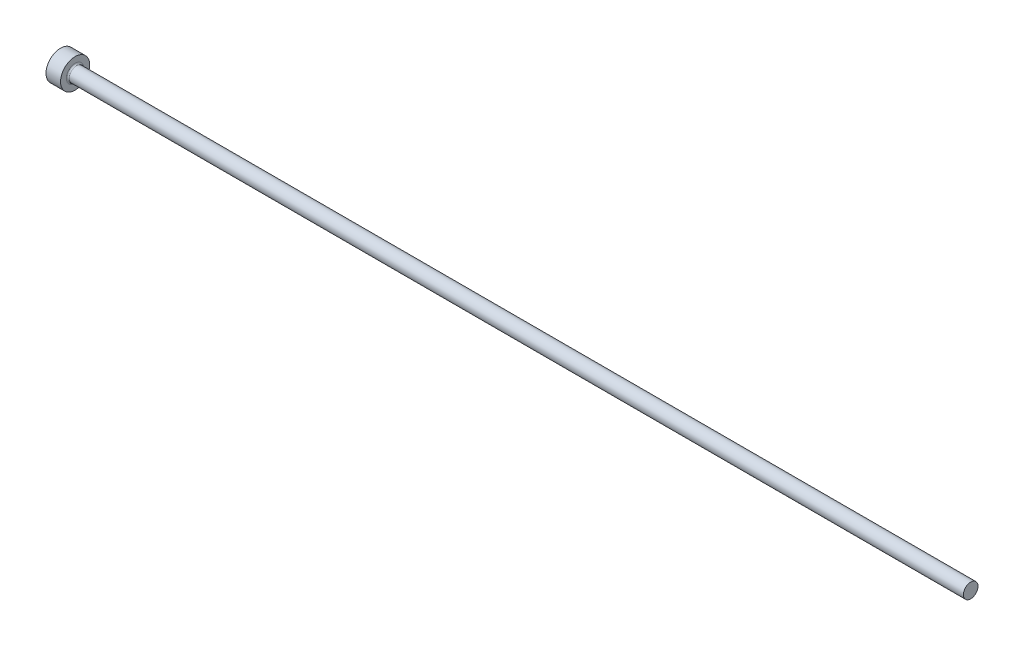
ISO-10303-21;
HEADER;
FILE_DESCRIPTION(('STEP AP214'),'2;1');
FILE_NAME('part.step','',(''),(''),'','','');
FILE_SCHEMA(('AUTOMOTIVE_DESIGN { 1 0 10303 214 1 1 1 1 }'));
ENDSEC;
DATA;
#1=APPLICATION_CONTEXT('core data for automotive mechanical design processes');
#2=APPLICATION_PROTOCOL_DEFINITION('international standard','automotive_design',2000,#1);
#3=PRODUCT_CONTEXT('',#1,'mechanical');
#4=PRODUCT('Part','Part','',(#3));
#5=PRODUCT_RELATED_PRODUCT_CATEGORY('part','',(#4));
#6=PRODUCT_DEFINITION_FORMATION('','',#4);
#7=PRODUCT_DEFINITION_CONTEXT('part definition',#1,'design');
#8=PRODUCT_DEFINITION('design','',#6,#7);
#9=PRODUCT_DEFINITION_SHAPE('','',#8);
#10=(LENGTH_UNIT() NAMED_UNIT(*) SI_UNIT(.MILLI.,.METRE.));
#11=(NAMED_UNIT(*) PLANE_ANGLE_UNIT() SI_UNIT($,.RADIAN.));
#12=(NAMED_UNIT(*) SI_UNIT($,.STERADIAN.) SOLID_ANGLE_UNIT());
#13=UNCERTAINTY_MEASURE_WITH_UNIT(LENGTH_MEASURE(1.E-05),#10,'distance_accuracy_value','');
#14=(GEOMETRIC_REPRESENTATION_CONTEXT(3) GLOBAL_UNCERTAINTY_ASSIGNED_CONTEXT((#13)) GLOBAL_UNIT_ASSIGNED_CONTEXT((#10,
#11,#12)) REPRESENTATION_CONTEXT('',''));
#15=CARTESIAN_POINT('',(0.,0.,0.));
#16=DIRECTION('',(0.,0.,1.));
#17=DIRECTION('',(1.,0.,0.));
#18=AXIS2_PLACEMENT_3D('',#15,#16,#17);
#19=CARTESIAN_POINT('',(0.,0.,0.));
#20=DIRECTION('',(-1.,0.,0.));
#21=DIRECTION('',(0.,-1.,0.));
#22=AXIS2_PLACEMENT_3D('',#19,#20,#21);
#23=PLANE('',#22);
#24=CARTESIAN_POINT('',(0.,0.,0.));
#25=DIRECTION('',(1.,0.,0.));
#26=DIRECTION('',(0.,1.,0.));
#27=AXIS2_PLACEMENT_3D('',#24,#25,#26);
#28=CIRCLE('',#27,2.);
#29=CARTESIAN_POINT('',(0.,2.,0.));
#30=VERTEX_POINT('',#29);
#31=EDGE_CURVE('E25',#30,#30,#28,.T.);
#32=ORIENTED_EDGE('',*,*,#31,.F.);
#33=EDGE_LOOP('',(#32));
#34=FACE_BOUND('',#33,.T.);
#35=ADVANCED_FACE('F14',(#34),#23,.T.);
#36=CARTESIAN_POINT('',(125.,0.,0.));
#37=DIRECTION('',(1.,0.,0.));
#38=DIRECTION('',(0.,1.,0.));
#39=AXIS2_PLACEMENT_3D('',#36,#37,#38);
#40=CYLINDRICAL_SURFACE('',#39,2.);
#41=ORIENTED_EDGE('',*,*,#31,.T.);
#42=EDGE_LOOP('',(#41));
#43=FACE_BOUND('',#42,.T.);
#44=CARTESIAN_POINT('',(2.,0.,0.));
#45=DIRECTION('',(1.,0.,0.));
#46=DIRECTION('',(0.,1.,0.));
#47=AXIS2_PLACEMENT_3D('',#44,#45,#46);
#48=CIRCLE('',#47,2.);
#49=CARTESIAN_POINT('',(2.,2.,0.));
#50=VERTEX_POINT('',#49);
#51=EDGE_CURVE('E29',#50,#50,#48,.T.);
#52=ORIENTED_EDGE('',*,*,#51,.F.);
#53=EDGE_LOOP('',(#52));
#54=FACE_BOUND('',#53,.T.);
#55=ADVANCED_FACE('F51',(#43,#54),#40,.T.);
#56=CARTESIAN_POINT('',(2.,2.,0.));
#57=DIRECTION('',(1.,0.,0.));
#58=DIRECTION('',(0.,1.,0.));
#59=AXIS2_PLACEMENT_3D('',#56,#57,#58);
#60=PLANE('',#59);
#61=CARTESIAN_POINT('',(2.,0.,0.));
#62=DIRECTION('',(1.,0.,0.));
#63=DIRECTION('',(0.,1.,0.));
#64=AXIS2_PLACEMENT_3D('',#61,#62,#63);
#65=CIRCLE('',#64,1.19999999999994);
#66=CARTESIAN_POINT('',(2.,1.19999999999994,0.));
#67=VERTEX_POINT('',#66);
#68=EDGE_CURVE('E9',#67,#67,#65,.F.);
#69=ORIENTED_EDGE('',*,*,#68,.T.);
#70=EDGE_LOOP('',(#69));
#71=FACE_BOUND('',#70,.T.);
#72=ORIENTED_EDGE('',*,*,#51,.T.);
#73=EDGE_LOOP('',(#72));
#74=FACE_BOUND('',#73,.T.);
#75=ADVANCED_FACE('F42',(#71,#74),#60,.T.);
#76=CARTESIAN_POINT('',(125.,0.,0.));
#77=DIRECTION('',(1.,0.,0.));
#78=DIRECTION('',(0.,1.,0.));
#79=AXIS2_PLACEMENT_3D('',#76,#77,#78);
#80=CYLINDRICAL_SURFACE('',#79,0.999999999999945);
#81=CARTESIAN_POINT('',(2.2,0.,0.));
#82=DIRECTION('',(1.,0.,0.));
#83=DIRECTION('',(0.,1.,0.));
#84=AXIS2_PLACEMENT_3D('',#81,#82,#83);
#85=CIRCLE('',#84,0.999999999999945);
#86=CARTESIAN_POINT('',(2.2,0.999999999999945,0.));
#87=VERTEX_POINT('',#86);
#88=EDGE_CURVE('E21',#87,#87,#85,.T.);
#89=ORIENTED_EDGE('',*,*,#88,.T.);
#90=EDGE_LOOP('',(#89));
#91=FACE_BOUND('',#90,.T.);
#92=CARTESIAN_POINT('',(125.,0.,0.));
#93=DIRECTION('',(1.,0.,0.));
#94=DIRECTION('',(0.,1.,0.));
#95=AXIS2_PLACEMENT_3D('',#92,#93,#94);
#96=CIRCLE('',#95,0.999999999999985);
#97=CARTESIAN_POINT('',(125.,0.999999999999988,0.));
#98=VERTEX_POINT('',#97);
#99=EDGE_CURVE('E34',#98,#98,#96,.T.);
#100=ORIENTED_EDGE('',*,*,#99,.F.);
#101=EDGE_LOOP('',(#100));
#102=FACE_BOUND('',#101,.T.);
#103=ADVANCED_FACE('F40',(#91,#102),#80,.T.);
#104=CARTESIAN_POINT('',(125.,0.999999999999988,0.));
#105=DIRECTION('',(1.,0.,0.));
#106=DIRECTION('',(0.,1.,0.));
#107=AXIS2_PLACEMENT_3D('',#104,#105,#106);
#108=PLANE('',#107);
#109=ORIENTED_EDGE('',*,*,#99,.T.);
#110=EDGE_LOOP('',(#109));
#111=FACE_BOUND('',#110,.T.);
#112=ADVANCED_FACE('F38',(#111),#108,.T.);
#113=CARTESIAN_POINT('',(2.2,0.,0.));
#114=DIRECTION('',(1.,0.,0.));
#115=DIRECTION('',(0.,1.,0.));
#116=AXIS2_PLACEMENT_3D('',#113,#114,#115);
#117=TOROIDAL_SURFACE('',#116,1.19999999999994,0.2);
#118=ORIENTED_EDGE('',*,*,#68,.F.);
#119=EDGE_LOOP('',(#118));
#120=FACE_BOUND('',#119,.T.);
#121=ORIENTED_EDGE('',*,*,#88,.F.);
#122=EDGE_LOOP('',(#121));
#123=FACE_BOUND('',#122,.T.);
#124=ADVANCED_FACE('F16',(#120,#123),#117,.F.);
#125=CLOSED_SHELL('',(#35,#55,#75,#103,#112,#124));
#126=MANIFOLD_SOLID_BREP('B1',#125);
#127=ADVANCED_BREP_SHAPE_REPRESENTATION('',(#18,#126),#14);
#128=SHAPE_DEFINITION_REPRESENTATION(#9,#127);
ENDSEC;
END-ISO-10303-21;
